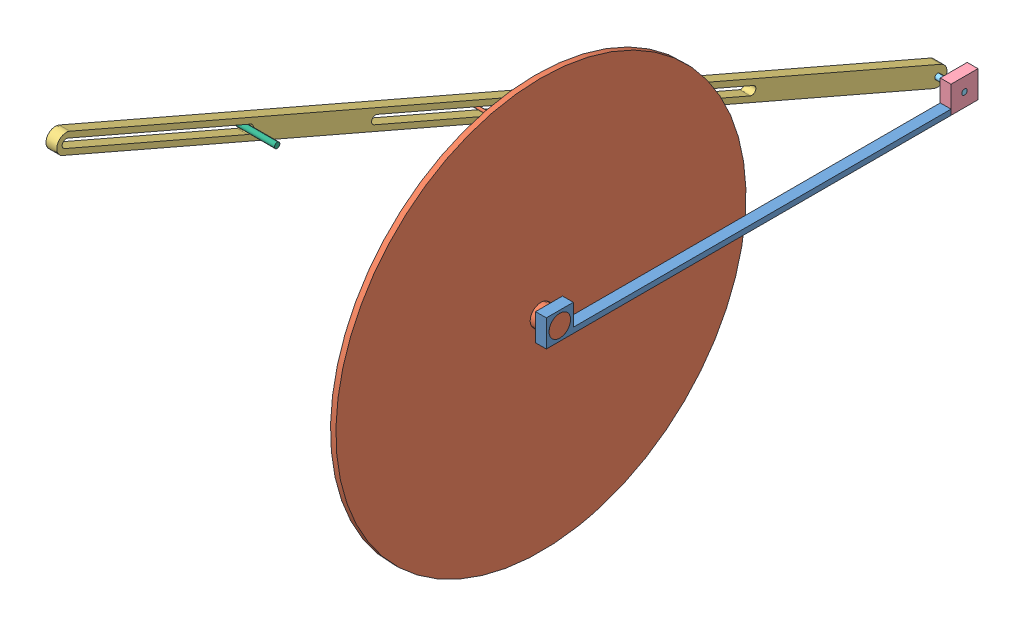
SolidWorks assembly fws.SLDASM, configuration Default (file format 10000). Lengths in mm.
Overall size (71.55 1183 1662.84).
6 component instances, 6 part files, 9 mates.
Components (placement in the parent):
- fw holder-1: fw holder.SLDPRT [Default] at (-10.3585 -21.7406 22.9748) size (20 50 750)
- flywheel-1: flywheel.SLDPRT [Default] at (-35.3585 3.2594 -2.0252) x (1 0 0) z (0 0.97084 0.239727) size (70 760 760)
- qr handle-1: qr handle.SLDPRT [Default] at (-60.3585 3.2594 -752.0252) x (1 0 0) z (0 -0.397708 -0.917512) size (20 35 1795)
- qr handle holder-1: qr handle holder.SLDPRT [Default] at (-10.3585 -21.7406 -727.0252) size (20 50 50)
- pin qr-1: pin qr.SLDPRT [Default] at (-60.3585 3.2594 -752.0252) size (70 10 10)
- pin666-1: pin666.SLDPRT [Default] at (11.1885 556.0738 523.3164) x (0 0 -1) z (1 0 0) size (10 10 71.55)
Mates (geometry in assembly coordinates):
- Coincident1: coincident: plane of fw holder-1 through (-10.3585 -21.7406 -727.0252) normal (0 0 -1); plane of qr handle holder-1 through (9.6415 -21.7406 -727.0252) normal (0 0 1)
- Coincident2: coincident: moEndPointRef_w of fw holder-1; moEndPointRef_w of qr handle holder-1
- Coincident3: coincident: plane of fw holder-1 through (9.6415 -21.7406 22.9748) normal (0 -1 0); plane of qr handle holder-1 through (9.6415 -21.7406 -727.0252) normal (0 -1 0)
- Hinge7: hinge: cylinder of pin qr-1 through (9.6415 3.2594 -752.0252) axis (-1 0 0) radius 5; cylinder of qr handle holder-1 through (9.6415 3.2594 -752.0252) axis (-1 0 0) radius 5; plane of pin qr-1 through (9.6415 3.2594 -752.0252) normal (1 0 0); plane of qr handle holder-1 through (9.6415 -21.7406 -727.0252) normal (1 0 0)
- Hinge8: hinge: cylinder of flywheel-1 through (9.6415 3.2594 -2.0252) axis (-1 0 0) radius 20; cylinder of fw holder-1 through (9.6415 3.2594 -2.0252) axis (-1 0 0) radius 20; plane of flywheel-1 through (9.6415 3.2594 -2.0252) normal (1 0 0); plane of fw holder-1 through (9.6415 -21.7406 22.9748) normal (1 0 0)
- Hinge9: hinge: cylinder of pin qr-1 through (9.6415 3.2594 -752.0252) axis (-1 0 0) radius 5; cylinder of qr handle-1 through (-40.3585 3.2594 -752.0252) axis (-1 0 0) radius 5; plane of pin qr-1 through (-60.3585 3.2594 -752.0252) normal (-1 0 0); plane of qr handle-1 through (-60.3585 3.2594 -752.0252) normal (-1 0 0)
- Slot1: slot: cylinder of flywheel-1 through (-60.3585 108.0545 -362.0849) axis (1 0 0) radius 2.5; plane of qr handle-1 through (-40.3585 93.3429 -387.9288) normal (0 0.965733 -0.259538); cylinder of qr handle-1 through (-40.3585 297.8345 344.0818) axis (-1 0 0) radius 7.5
- Slot2: slot: cylinder of pin666-1 through (-60.3585 388.1049 679.9761) axis (1 0 0) radius 5; plane of qr handle-1 through (-40.3585 452.8024 949.6115) normal (0 0.965733 -0.259538); cylinder of qr handle-1 through (-40.3585 460.0454 947.6649) axis (-1 0 0) radius 7.5
- Coincident4: coincident: plane of qr handle-1 through (-60.3585 3.2594 -752.0252) normal (-1 0 0); plane of pin666-1 through (-60.3585 388.1049 679.9761) normal (-1 0 0)
